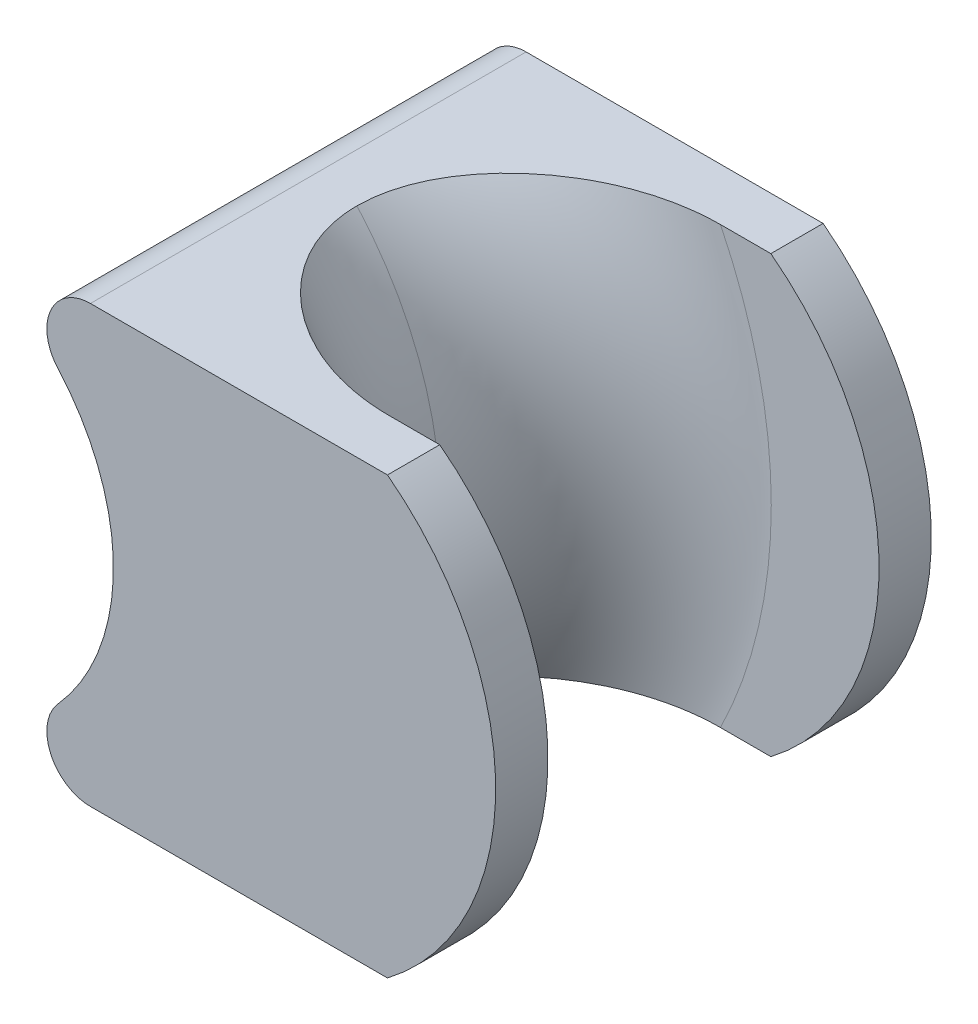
ISO-10303-21;
HEADER;
FILE_DESCRIPTION(('STEP AP214'),'2;1');
FILE_NAME('part.step','',(''),(''),'','','');
FILE_SCHEMA(('AUTOMOTIVE_DESIGN { 1 0 10303 214 1 1 1 1 }'));
ENDSEC;
DATA;
#1=APPLICATION_CONTEXT('core data for automotive mechanical design processes');
#2=APPLICATION_PROTOCOL_DEFINITION('international standard','automotive_design',2000,#1);
#3=PRODUCT_CONTEXT('',#1,'mechanical');
#4=PRODUCT('Part','Part','',(#3));
#5=PRODUCT_RELATED_PRODUCT_CATEGORY('part','',(#4));
#6=PRODUCT_DEFINITION_FORMATION('','',#4);
#7=PRODUCT_DEFINITION_CONTEXT('part definition',#1,'design');
#8=PRODUCT_DEFINITION('design','',#6,#7);
#9=PRODUCT_DEFINITION_SHAPE('','',#8);
#10=(LENGTH_UNIT() NAMED_UNIT(*) SI_UNIT(.MILLI.,.METRE.));
#11=(NAMED_UNIT(*) PLANE_ANGLE_UNIT() SI_UNIT($,.RADIAN.));
#12=(NAMED_UNIT(*) SI_UNIT($,.STERADIAN.) SOLID_ANGLE_UNIT());
#13=UNCERTAINTY_MEASURE_WITH_UNIT(LENGTH_MEASURE(1.E-05),#10,'distance_accuracy_value','');
#14=(GEOMETRIC_REPRESENTATION_CONTEXT(3) GLOBAL_UNCERTAINTY_ASSIGNED_CONTEXT((#13)) GLOBAL_UNIT_ASSIGNED_CONTEXT((#10,
#11,#12)) REPRESENTATION_CONTEXT('',''));
#15=CARTESIAN_POINT('',(0.,0.,0.));
#16=DIRECTION('',(0.,0.,1.));
#17=DIRECTION('',(1.,0.,0.));
#18=AXIS2_PLACEMENT_3D('',#15,#16,#17);
#19=CARTESIAN_POINT('',(0.,0.,12.7));
#20=DIRECTION('',(0.,0.,-1.));
#21=DIRECTION('',(-1.,0.,0.));
#22=AXIS2_PLACEMENT_3D('',#19,#20,#21);
#23=CYLINDRICAL_SURFACE('',#22,6.35);
#24=CARTESIAN_POINT('',(0.,0.,0.));
#25=DIRECTION('',(0.,0.,1.));
#26=DIRECTION('',(1.,0.,0.));
#27=AXIS2_PLACEMENT_3D('',#24,#25,#26);
#28=CIRCLE('',#27,6.35);
#29=CARTESIAN_POINT('',(4.73301055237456,-4.23333333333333,0.));
#30=VERTEX_POINT('',#29);
#31=CARTESIAN_POINT('',(4.73301055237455,4.23333333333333,0.));
#32=VERTEX_POINT('',#31);
#33=EDGE_CURVE('E163',#30,#32,#28,.T.);
#34=ORIENTED_EDGE('',*,*,#33,.F.);
#35=DIRECTION('',(0.,0.,-1.));
#36=VECTOR('',#35,1.);
#37=CARTESIAN_POINT('',(4.73301055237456,-4.23333333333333,12.7));
#38=LINE('',#37,#36);
#39=CARTESIAN_POINT('',(4.73301055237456,-4.23333333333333,12.7));
#40=VERTEX_POINT('',#39);
#41=EDGE_CURVE('E232',#30,#40,#38,.F.);
#42=ORIENTED_EDGE('',*,*,#41,.T.);
#43=CARTESIAN_POINT('',(0.,0.,12.7));
#44=DIRECTION('',(0.,0.,1.));
#45=DIRECTION('',(1.,0.,0.));
#46=AXIS2_PLACEMENT_3D('',#43,#44,#45);
#47=CIRCLE('',#46,6.35);
#48=CARTESIAN_POINT('',(4.73301055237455,4.23333333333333,12.7));
#49=VERTEX_POINT('',#48);
#50=EDGE_CURVE('E166',#40,#49,#47,.T.);
#51=ORIENTED_EDGE('',*,*,#50,.T.);
#52=DIRECTION('',(0.,0.,-1.));
#53=VECTOR('',#52,1.);
#54=CARTESIAN_POINT('',(4.73301055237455,4.23333333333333,12.7));
#55=LINE('',#54,#53);
#56=EDGE_CURVE('E229',#49,#32,#55,.T.);
#57=ORIENTED_EDGE('',*,*,#56,.T.);
#58=EDGE_LOOP('',(#34,#42,#51,#57));
#59=FACE_BOUND('',#58,.T.);
#60=ADVANCED_FACE('F37',(#59),#23,.F.);
#61=CARTESIAN_POINT('',(0.,-6.35,12.7));
#62=DIRECTION('',(0.,1.,0.));
#63=DIRECTION('',(0.,0.,1.));
#64=AXIS2_PLACEMENT_3D('',#61,#62,#63);
#65=PLANE('',#64);
#66=DIRECTION('',(1.,0.,0.));
#67=VECTOR('',#66,1.);
#68=CARTESIAN_POINT('',(0.,-6.35,12.7));
#69=LINE('',#68,#67);
#70=CARTESIAN_POINT('',(5.67961266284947,-6.35,12.7));
#71=VERTEX_POINT('',#70);
#72=CARTESIAN_POINT('',(14.3385158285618,-6.35,12.7));
#73=VERTEX_POINT('',#72);
#74=EDGE_CURVE('E168',#71,#73,#69,.T.);
#75=ORIENTED_EDGE('',*,*,#74,.F.);
#76=DIRECTION('',(0.,0.,1.));
#77=VECTOR('',#76,1.);
#78=CARTESIAN_POINT('',(5.67961266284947,-6.35,0.));
#79=LINE('',#78,#77);
#80=CARTESIAN_POINT('',(5.67961266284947,-6.35,0.));
#81=VERTEX_POINT('',#80);
#82=EDGE_CURVE('E222',#71,#81,#79,.F.);
#83=ORIENTED_EDGE('',*,*,#82,.T.);
#84=DIRECTION('',(1.,0.,0.));
#85=VECTOR('',#84,1.);
#86=CARTESIAN_POINT('',(0.,-6.35,0.));
#87=LINE('',#86,#85);
#88=CARTESIAN_POINT('',(14.3385158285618,-6.35,0.));
#89=VERTEX_POINT('',#88);
#90=EDGE_CURVE('E176',#81,#89,#87,.T.);
#91=ORIENTED_EDGE('',*,*,#90,.T.);
#92=DIRECTION('',(0.,0.,-1.));
#93=VECTOR('',#92,1.);
#94=CARTESIAN_POINT('',(14.3385158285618,-6.35,1.524));
#95=LINE('',#94,#93);
#96=CARTESIAN_POINT('',(14.3385158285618,-6.35,1.524));
#97=VERTEX_POINT('',#96);
#98=EDGE_CURVE('E142',#97,#89,#95,.T.);
#99=ORIENTED_EDGE('',*,*,#98,.F.);
#100=DIRECTION('',(1.,0.,0.));
#101=VECTOR('',#100,1.);
#102=CARTESIAN_POINT('',(7.09951582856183,-6.35,1.524));
#103=LINE('',#102,#101);
#104=CARTESIAN_POINT('',(12.8696814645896,-6.35,1.524));
#105=VERTEX_POINT('',#104);
#106=EDGE_CURVE('E134',#105,#97,#103,.T.);
#107=ORIENTED_EDGE('',*,*,#106,.F.);
#108=CARTESIAN_POINT('',(12.8696814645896,-6.35,1.524));
#109=CARTESIAN_POINT('',(12.6630423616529,-6.35,1.52398428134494));
#110=CARTESIAN_POINT('',(12.4564641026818,-6.35,1.5346716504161));
#111=CARTESIAN_POINT('',(12.0454777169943,-6.35,1.57670436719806));
#112=CARTESIAN_POINT('',(11.8410689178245,-6.35,1.60804311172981));
#113=CARTESIAN_POINT('',(11.4364085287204,-6.35,1.69061637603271));
#114=CARTESIAN_POINT('',(11.2361554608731,-6.35,1.7418436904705));
#115=CARTESIAN_POINT('',(10.8415499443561,-6.35,1.86340282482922));
#116=CARTESIAN_POINT('',(10.6471970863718,-6.35,1.9337333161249));
#117=CARTESIAN_POINT('',(10.2940935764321,-6.35,2.08108120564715));
#118=CARTESIAN_POINT('',(10.134300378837,-6.35,2.15560705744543));
#119=CARTESIAN_POINT('',(9.82145750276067,-6.35,2.31754343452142));
#120=CARTESIAN_POINT('',(9.66840733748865,-6.35,2.40495302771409));
#121=CARTESIAN_POINT('',(9.22119005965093,-6.35,2.68588662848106));
#122=CARTESIAN_POINT('',(8.93845785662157,-6.35,2.89832275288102));
#123=CARTESIAN_POINT('',(8.46826655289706,-6.35,3.32291475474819));
#124=CARTESIAN_POINT('',(8.27307394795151,-6.35,3.52657350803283));
#125=CARTESIAN_POINT('',(7.91774045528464,-6.35,3.96255368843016));
#126=CARTESIAN_POINT('',(7.75755341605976,-6.35,4.19483673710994));
#127=CARTESIAN_POINT('',(7.51059008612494,-6.35,4.63514212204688));
#128=CARTESIAN_POINT('',(7.41550445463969,-6.35,4.8384478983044));
#129=CARTESIAN_POINT('',(7.29904041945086,-6.35,5.15275782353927));
#130=CARTESIAN_POINT('',(7.26459480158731,-6.35,5.25900864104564));
#131=CARTESIAN_POINT('',(7.20503464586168,-6.35,5.47407733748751));
#132=CARTESIAN_POINT('',(7.17991616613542,-6.35,5.58289411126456));
#133=CARTESIAN_POINT('',(7.13984854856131,-6.35,5.8009407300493));
#134=CARTESIAN_POINT('',(7.12477261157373,-6.35,5.91014720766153));
#135=CARTESIAN_POINT('',(7.10458148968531,-6.35,6.12956070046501));
#136=CARTESIAN_POINT('',(7.09947418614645,-6.35,6.23976843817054));
#137=CARTESIAN_POINT('',(7.09951582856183,-6.35,6.35));
#138=B_SPLINE_CURVE_WITH_KNOTS('',3,(#108,#109,#110,#111,#112,#113,#114,#115,#116,#117,#118,
#119,#120,#121,#122,#123,#124,#125,#126,#127,#128,#129,#130,#131,#132,#133,#134,#135,#136,#137),
.UNSPECIFIED.,.F.,.F.,(4,2,2,2,2,2,2,2,2,2,2,2,2,2,4),(0.,0.619554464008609,1.23891092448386,
1.85804321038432,2.47713244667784,3.00546923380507,3.53376781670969,4.58876483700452,
5.43206940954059,6.2742553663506,6.94464668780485,7.27937368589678,7.61395905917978,
7.9442354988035,8.27477295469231),.UNSPECIFIED.);
#139=CARTESIAN_POINT('',(7.09951582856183,-6.35,6.35));
#140=VERTEX_POINT('',#139);
#141=EDGE_CURVE('E217',#105,#140,#138,.T.);
#142=ORIENTED_EDGE('',*,*,#141,.T.);
#143=CARTESIAN_POINT('',(7.09951582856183,-6.35,6.35));
#144=CARTESIAN_POINT('',(7.09946628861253,-6.35,6.46524627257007));
#145=CARTESIAN_POINT('',(7.10505270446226,-6.35,6.58046410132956));
#146=CARTESIAN_POINT('',(7.12711322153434,-6.35,6.80974171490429));
#147=CARTESIAN_POINT('',(7.14357652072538,-6.35,6.92380253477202));
#148=CARTESIAN_POINT('',(7.18680699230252,-6.35,7.14885120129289));
#149=CARTESIAN_POINT('',(7.21347739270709,-6.35,7.25985771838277));
#150=CARTESIAN_POINT('',(7.27647529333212,-6.35,7.47908171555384));
#151=CARTESIAN_POINT('',(7.31280474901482,-6.35,7.58729862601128));
#152=CARTESIAN_POINT('',(7.4348662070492,-6.35,7.90590440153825));
#153=CARTESIAN_POINT('',(7.533887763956,-6.35,8.11131809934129));
#154=CARTESIAN_POINT('',(7.76130576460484,-6.35,8.5055238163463));
#155=CARTESIAN_POINT('',(7.88978678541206,-6.35,8.69426576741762));
#156=CARTESIAN_POINT('',(8.22651304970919,-6.35,9.12476575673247));
#157=CARTESIAN_POINT('',(8.44613610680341,-6.35,9.35765589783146));
#158=CARTESIAN_POINT('',(8.92020334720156,-6.35,9.78462354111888));
#159=CARTESIAN_POINT('',(9.17468495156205,-6.35,9.9786587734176));
#160=CARTESIAN_POINT('',(9.7135205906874,-6.35,10.3281364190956));
#161=CARTESIAN_POINT('',(9.99821829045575,-6.35,10.4830474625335));
#162=CARTESIAN_POINT('',(10.5873097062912,-6.35,10.7483008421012));
#163=CARTESIAN_POINT('',(10.8916823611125,-6.35,10.8586899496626));
#164=CARTESIAN_POINT('',(11.4735621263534,-6.35,11.0210308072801));
#165=CARTESIAN_POINT('',(11.7494885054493,-6.35,11.0786731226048));
#166=CARTESIAN_POINT('',(12.3067539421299,-6.35,11.1561855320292));
#167=CARTESIAN_POINT('',(12.5880964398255,-6.35,11.1760307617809));
#168=CARTESIAN_POINT('',(12.8696814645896,-6.35,11.176));
#169=B_SPLINE_CURVE_WITH_KNOTS('',3,(#143,#144,#145,#146,#147,#148,#149,#150,#151,#152,#153,
#154,#155,#156,#157,#158,#159,#160,#161,#162,#163,#164,#165,#166,#167,#168),.UNSPECIFIED.,.F.,
.F.,(4,2,2,2,2,2,2,2,2,2,2,2,4),(0.,0.345557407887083,0.69077215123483,1.03279194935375,
1.37488104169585,2.05582746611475,2.73875389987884,3.69398181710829,4.65024333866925,
5.6188676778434,6.58647178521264,7.42960555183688,8.27329377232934),.UNSPECIFIED.);
#170=CARTESIAN_POINT('',(12.8696814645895,-6.35000000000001,11.176));
#171=VERTEX_POINT('',#170);
#172=EDGE_CURVE('E183',#140,#171,#169,.T.);
#173=ORIENTED_EDGE('',*,*,#172,.T.);
#174=DIRECTION('',(1.,0.,0.));
#175=VECTOR('',#174,1.);
#176=CARTESIAN_POINT('',(0.,-6.35,11.176));
#177=LINE('',#176,#175);
#178=CARTESIAN_POINT('',(14.3385158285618,-6.35,11.176));
#179=VERTEX_POINT('',#178);
#180=EDGE_CURVE('E152',#171,#179,#177,.T.);
#181=ORIENTED_EDGE('',*,*,#180,.T.);
#182=DIRECTION('',(0.,0.,1.));
#183=VECTOR('',#182,1.);
#184=CARTESIAN_POINT('',(14.3385158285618,-6.35,11.176));
#185=LINE('',#184,#183);
#186=EDGE_CURVE('E157',#179,#73,#185,.T.);
#187=ORIENTED_EDGE('',*,*,#186,.T.);
#188=EDGE_LOOP('',(#75,#83,#91,#99,#107,#142,#173,#181,#187));
#189=FACE_BOUND('',#188,.T.);
#190=ADVANCED_FACE('F196',(#189),#65,.F.);
#191=CARTESIAN_POINT('',(0.,6.35,12.7));
#192=DIRECTION('',(0.,1.,0.));
#193=DIRECTION('',(-1.,0.,0.));
#194=AXIS2_PLACEMENT_3D('',#191,#192,#193);
#195=PLANE('',#194);
#196=DIRECTION('',(1.,0.,0.));
#197=VECTOR('',#196,1.);
#198=CARTESIAN_POINT('',(0.,6.35,0.));
#199=LINE('',#198,#197);
#200=CARTESIAN_POINT('',(5.67961266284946,6.35,0.));
#201=VERTEX_POINT('',#200);
#202=CARTESIAN_POINT('',(14.3385158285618,6.35,0.));
#203=VERTEX_POINT('',#202);
#204=EDGE_CURVE('E169',#201,#203,#199,.T.);
#205=ORIENTED_EDGE('',*,*,#204,.F.);
#206=DIRECTION('',(0.,0.,-1.));
#207=VECTOR('',#206,1.);
#208=CARTESIAN_POINT('',(5.67961266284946,6.35,12.7));
#209=LINE('',#208,#207);
#210=CARTESIAN_POINT('',(5.67961266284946,6.35,12.7));
#211=VERTEX_POINT('',#210);
#212=EDGE_CURVE('E11',#201,#211,#209,.F.);
#213=ORIENTED_EDGE('',*,*,#212,.T.);
#214=DIRECTION('',(1.,0.,0.));
#215=VECTOR('',#214,1.);
#216=CARTESIAN_POINT('',(0.,6.35,12.7));
#217=LINE('',#216,#215);
#218=CARTESIAN_POINT('',(14.3385158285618,6.35,12.7));
#219=VERTEX_POINT('',#218);
#220=EDGE_CURVE('E171',#211,#219,#217,.T.);
#221=ORIENTED_EDGE('',*,*,#220,.T.);
#222=DIRECTION('',(0.,0.,1.));
#223=VECTOR('',#222,1.);
#224=CARTESIAN_POINT('',(14.3385158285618,6.35,11.176));
#225=LINE('',#224,#223);
#226=CARTESIAN_POINT('',(14.3385158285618,6.35,11.176));
#227=VERTEX_POINT('',#226);
#228=EDGE_CURVE('E160',#227,#219,#225,.T.);
#229=ORIENTED_EDGE('',*,*,#228,.F.);
#230=DIRECTION('',(-1.,0.,0.));
#231=VECTOR('',#230,1.);
#232=CARTESIAN_POINT('',(7.09951582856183,6.35,11.176));
#233=LINE('',#232,#231);
#234=CARTESIAN_POINT('',(12.8696814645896,6.35,11.176));
#235=VERTEX_POINT('',#234);
#236=EDGE_CURVE('E149',#227,#235,#233,.T.);
#237=ORIENTED_EDGE('',*,*,#236,.T.);
#238=CARTESIAN_POINT('',(12.8696814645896,6.35,11.176));
#239=CARTESIAN_POINT('',(12.6630423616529,6.35,11.1760157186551));
#240=CARTESIAN_POINT('',(12.4564641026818,6.35,11.1653283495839));
#241=CARTESIAN_POINT('',(12.0454777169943,6.35,11.1232956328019));
#242=CARTESIAN_POINT('',(11.8410689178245,6.35,11.0919568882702));
#243=CARTESIAN_POINT('',(11.4364085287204,6.35,11.0093836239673));
#244=CARTESIAN_POINT('',(11.2361554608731,6.35,10.9581563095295));
#245=CARTESIAN_POINT('',(10.8415499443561,6.35,10.8365971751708));
#246=CARTESIAN_POINT('',(10.6471970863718,6.35,10.7662666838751));
#247=CARTESIAN_POINT('',(10.2940935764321,6.35,10.6189187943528));
#248=CARTESIAN_POINT('',(10.134300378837,6.35,10.5443929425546));
#249=CARTESIAN_POINT('',(9.82145750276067,6.35,10.3824565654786));
#250=CARTESIAN_POINT('',(9.66840733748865,6.35,10.2950469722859));
#251=CARTESIAN_POINT('',(9.22119005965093,6.35,10.0141133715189));
#252=CARTESIAN_POINT('',(8.93845785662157,6.35,9.80167724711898));
#253=CARTESIAN_POINT('',(8.46826655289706,6.35,9.37708524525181));
#254=CARTESIAN_POINT('',(8.27307394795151,6.35,9.17342649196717));
#255=CARTESIAN_POINT('',(7.91774045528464,6.35,8.73744631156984));
#256=CARTESIAN_POINT('',(7.75755341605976,6.35,8.50516326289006));
#257=CARTESIAN_POINT('',(7.51059008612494,6.35,8.06485787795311));
#258=CARTESIAN_POINT('',(7.41550445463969,6.35,7.8615521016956));
#259=CARTESIAN_POINT('',(7.29904041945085,6.35,7.54724217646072));
#260=CARTESIAN_POINT('',(7.2645948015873,6.35,7.44099135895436));
#261=CARTESIAN_POINT('',(7.20503464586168,6.35,7.22592266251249));
#262=CARTESIAN_POINT('',(7.17991616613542,6.35,7.11710588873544));
#263=CARTESIAN_POINT('',(7.13984854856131,6.35,6.8990592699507));
#264=CARTESIAN_POINT('',(7.12477261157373,6.35,6.78985279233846));
#265=CARTESIAN_POINT('',(7.10458148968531,6.35,6.57043929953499));
#266=CARTESIAN_POINT('',(7.09947418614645,6.35,6.46023156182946));
#267=CARTESIAN_POINT('',(7.09951582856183,6.35,6.35));
#268=B_SPLINE_CURVE_WITH_KNOTS('',3,(#238,#239,#240,#241,#242,#243,#244,#245,#246,#247,#248,
#249,#250,#251,#252,#253,#254,#255,#256,#257,#258,#259,#260,#261,#262,#263,#264,#265,#266,#267),
.UNSPECIFIED.,.F.,.F.,(4,2,2,2,2,2,2,2,2,2,2,2,2,2,4),(0.,0.619554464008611,1.23891092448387,
1.85804321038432,2.47713244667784,3.00546923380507,3.5337678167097,4.58876483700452,
5.43206940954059,6.27425536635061,6.94464668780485,7.27937368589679,7.61395905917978,
7.94423549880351,8.27477295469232),.UNSPECIFIED.);
#269=CARTESIAN_POINT('',(7.09951582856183,6.35,6.35));
#270=VERTEX_POINT('',#269);
#271=EDGE_CURVE('E190',#235,#270,#268,.T.);
#272=ORIENTED_EDGE('',*,*,#271,.T.);
#273=CARTESIAN_POINT('',(7.09951582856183,6.35,6.35));
#274=CARTESIAN_POINT('',(7.09946628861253,6.35,6.23475372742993));
#275=CARTESIAN_POINT('',(7.10505270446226,6.35,6.11953589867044));
#276=CARTESIAN_POINT('',(7.12711322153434,6.35,5.89025828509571));
#277=CARTESIAN_POINT('',(7.14357652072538,6.35,5.77619746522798));
#278=CARTESIAN_POINT('',(7.18680699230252,6.35,5.55114879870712));
#279=CARTESIAN_POINT('',(7.21347739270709,6.35,5.44014228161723));
#280=CARTESIAN_POINT('',(7.27647529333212,6.35,5.22091828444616));
#281=CARTESIAN_POINT('',(7.31280474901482,6.35,5.11270137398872));
#282=CARTESIAN_POINT('',(7.4348662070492,6.35,4.79409559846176));
#283=CARTESIAN_POINT('',(7.53388776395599,6.35,4.58868190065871));
#284=CARTESIAN_POINT('',(7.76130576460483,6.35,4.1944761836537));
#285=CARTESIAN_POINT('',(7.88978678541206,6.35,4.00573423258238));
#286=CARTESIAN_POINT('',(8.22651304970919,6.35,3.57523424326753));
#287=CARTESIAN_POINT('',(8.44613610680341,6.35,3.34234410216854));
#288=CARTESIAN_POINT('',(8.92020334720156,6.35,2.91537645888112));
#289=CARTESIAN_POINT('',(9.17468495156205,6.35,2.7213412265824));
#290=CARTESIAN_POINT('',(9.71352059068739,6.35,2.37186358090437));
#291=CARTESIAN_POINT('',(9.99821829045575,6.35,2.21695253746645));
#292=CARTESIAN_POINT('',(10.5873097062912,6.35,1.95169915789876));
#293=CARTESIAN_POINT('',(10.8916823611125,6.35,1.84131005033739));
#294=CARTESIAN_POINT('',(11.4735621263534,6.35,1.67896919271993));
#295=CARTESIAN_POINT('',(11.7494885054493,6.35,1.62132687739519));
#296=CARTESIAN_POINT('',(12.3067539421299,6.35,1.54381446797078));
#297=CARTESIAN_POINT('',(12.5880964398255,6.35,1.52396923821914));
#298=CARTESIAN_POINT('',(12.8696814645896,6.35,1.524));
#299=B_SPLINE_CURVE_WITH_KNOTS('',3,(#273,#274,#275,#276,#277,#278,#279,#280,#281,#282,#283,
#284,#285,#286,#287,#288,#289,#290,#291,#292,#293,#294,#295,#296,#297,#298),.UNSPECIFIED.,.F.,
.F.,(4,2,2,2,2,2,2,2,2,2,2,2,4),(0.,0.345557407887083,0.69077215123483,1.03279194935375,
1.37488104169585,2.05582746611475,2.73875389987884,3.69398181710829,4.65024333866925,
5.6188676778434,6.58647178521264,7.42960555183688,8.27329377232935),.UNSPECIFIED.);
#300=CARTESIAN_POINT('',(12.8696814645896,6.35,1.524));
#301=VERTEX_POINT('',#300);
#302=EDGE_CURVE('E125',#270,#301,#299,.T.);
#303=ORIENTED_EDGE('',*,*,#302,.T.);
#304=DIRECTION('',(-1.,0.,0.));
#305=VECTOR('',#304,1.);
#306=CARTESIAN_POINT('',(7.09951582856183,6.35,1.524));
#307=LINE('',#306,#305);
#308=CARTESIAN_POINT('',(14.3385158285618,6.35,1.524));
#309=VERTEX_POINT('',#308);
#310=EDGE_CURVE('E119',#309,#301,#307,.T.);
#311=ORIENTED_EDGE('',*,*,#310,.F.);
#312=DIRECTION('',(0.,0.,-1.));
#313=VECTOR('',#312,1.);
#314=CARTESIAN_POINT('',(14.3385158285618,6.35,1.524));
#315=LINE('',#314,#313);
#316=EDGE_CURVE('E123',#309,#203,#315,.T.);
#317=ORIENTED_EDGE('',*,*,#316,.T.);
#318=EDGE_LOOP('',(#205,#213,#221,#229,#237,#272,#303,#311,#317));
#319=FACE_BOUND('',#318,.T.);
#320=ADVANCED_FACE('F121',(#319),#195,.T.);
#321=CARTESIAN_POINT('',(0.,0.,12.7));
#322=DIRECTION('',(0.,0.,1.));
#323=DIRECTION('',(1.,0.,0.));
#324=AXIS2_PLACEMENT_3D('',#321,#322,#323);
#325=PLANE('',#324);
#326=ORIENTED_EDGE('',*,*,#50,.F.);
#327=CARTESIAN_POINT('',(5.67961266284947,-5.08,12.7));
#328=DIRECTION('',(0.,0.,1.));
#329=DIRECTION('',(1.,0.,0.));
#330=AXIS2_PLACEMENT_3D('',#327,#328,#329);
#331=CIRCLE('',#330,1.27);
#332=EDGE_CURVE('E45',#40,#71,#331,.T.);
#333=ORIENTED_EDGE('',*,*,#332,.T.);
#334=ORIENTED_EDGE('',*,*,#74,.T.);
#335=CARTESIAN_POINT('',(9.525,0.,12.7));
#336=DIRECTION('',(0.,0.,1.));
#337=DIRECTION('',(-1.,0.,0.));
#338=AXIS2_PLACEMENT_3D('',#335,#336,#337);
#339=CIRCLE('',#338,7.96821401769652);
#340=EDGE_CURVE('E144',#73,#219,#339,.T.);
#341=ORIENTED_EDGE('',*,*,#340,.T.);
#342=ORIENTED_EDGE('',*,*,#220,.F.);
#343=CARTESIAN_POINT('',(5.67961266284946,5.08,12.7));
#344=DIRECTION('',(0.,0.,1.));
#345=DIRECTION('',(1.,0.,0.));
#346=AXIS2_PLACEMENT_3D('',#343,#344,#345);
#347=CIRCLE('',#346,1.27);
#348=EDGE_CURVE('E57',#211,#49,#347,.T.);
#349=ORIENTED_EDGE('',*,*,#348,.T.);
#350=EDGE_LOOP('',(#326,#333,#334,#341,#342,#349));
#351=FACE_BOUND('',#350,.T.);
#352=ADVANCED_FACE('F236',(#351),#325,.T.);
#353=CARTESIAN_POINT('',(0.,0.,0.));
#354=DIRECTION('',(0.,0.,1.));
#355=DIRECTION('',(1.,0.,0.));
#356=AXIS2_PLACEMENT_3D('',#353,#354,#355);
#357=PLANE('',#356);
#358=ORIENTED_EDGE('',*,*,#90,.F.);
#359=CARTESIAN_POINT('',(5.67961266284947,-5.08,0.));
#360=DIRECTION('',(0.,0.,1.));
#361=DIRECTION('',(1.,0.,0.));
#362=AXIS2_PLACEMENT_3D('',#359,#360,#361);
#363=CIRCLE('',#362,1.27);
#364=EDGE_CURVE('E227',#81,#30,#363,.F.);
#365=ORIENTED_EDGE('',*,*,#364,.T.);
#366=ORIENTED_EDGE('',*,*,#33,.T.);
#367=CARTESIAN_POINT('',(5.67961266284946,5.08,0.));
#368=DIRECTION('',(0.,0.,1.));
#369=DIRECTION('',(1.,0.,0.));
#370=AXIS2_PLACEMENT_3D('',#367,#368,#369);
#371=CIRCLE('',#370,1.27);
#372=EDGE_CURVE('E225',#32,#201,#371,.F.);
#373=ORIENTED_EDGE('',*,*,#372,.T.);
#374=ORIENTED_EDGE('',*,*,#204,.T.);
#375=CARTESIAN_POINT('',(9.525,0.,0.));
#376=DIRECTION('',(0.,0.,1.));
#377=DIRECTION('',(-1.,0.,0.));
#378=AXIS2_PLACEMENT_3D('',#375,#376,#377);
#379=CIRCLE('',#378,7.96821401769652);
#380=EDGE_CURVE('E129',#89,#203,#379,.T.);
#381=ORIENTED_EDGE('',*,*,#380,.F.);
#382=EDGE_LOOP('',(#358,#365,#366,#373,#374,#381));
#383=FACE_BOUND('',#382,.T.);
#384=ADVANCED_FACE('F246',(#383),#357,.F.);
#385=CARTESIAN_POINT('',(9.525,0.,11.176));
#386=DIRECTION('',(0.,0.,1.));
#387=DIRECTION('',(1.,0.,0.));
#388=AXIS2_PLACEMENT_3D('',#385,#386,#387);
#389=CYLINDRICAL_SURFACE('',#388,7.96821401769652);
#390=ORIENTED_EDGE('',*,*,#340,.F.);
#391=ORIENTED_EDGE('',*,*,#186,.F.);
#392=CARTESIAN_POINT('',(9.525,0.,11.176));
#393=DIRECTION('',(0.,0.,1.));
#394=DIRECTION('',(-1.,0.,0.));
#395=AXIS2_PLACEMENT_3D('',#392,#393,#394);
#396=CIRCLE('',#395,7.96821401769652);
#397=EDGE_CURVE('E154',#179,#227,#396,.T.);
#398=ORIENTED_EDGE('',*,*,#397,.T.);
#399=ORIENTED_EDGE('',*,*,#228,.T.);
#400=EDGE_LOOP('',(#390,#391,#398,#399));
#401=FACE_BOUND('',#400,.T.);
#402=ADVANCED_FACE('F270',(#401),#389,.T.);
#403=CARTESIAN_POINT('',(0.,0.,11.176));
#404=DIRECTION('',(0.,0.,1.));
#405=DIRECTION('',(1.,0.,0.));
#406=AXIS2_PLACEMENT_3D('',#403,#404,#405);
#407=PLANE('',#406);
#408=ORIENTED_EDGE('',*,*,#180,.F.);
#409=CARTESIAN_POINT('',(0.,0.,11.176));
#410=DIRECTION('',(0.,0.,1.));
#411=DIRECTION('',(1.,0.,0.));
#412=AXIS2_PLACEMENT_3D('',#409,#410,#411);
#413=CIRCLE('',#412,14.351);
#414=EDGE_CURVE('E181',#171,#235,#413,.T.);
#415=ORIENTED_EDGE('',*,*,#414,.T.);
#416=ORIENTED_EDGE('',*,*,#236,.F.);
#417=ORIENTED_EDGE('',*,*,#397,.F.);
#418=EDGE_LOOP('',(#408,#415,#416,#417));
#419=FACE_BOUND('',#418,.T.);
#420=ADVANCED_FACE('F203',(#419),#407,.F.);
#421=CARTESIAN_POINT('',(0.,0.,6.35));
#422=DIRECTION('',(0.,0.,1.));
#423=DIRECTION('',(1.,0.,0.));
#424=AXIS2_PLACEMENT_3D('',#421,#422,#423);
#425=TOROIDAL_SURFACE('',#424,14.351,4.826);
#426=ORIENTED_EDGE('',*,*,#271,.F.);
#427=ORIENTED_EDGE('',*,*,#414,.F.);
#428=ORIENTED_EDGE('',*,*,#172,.F.);
#429=CARTESIAN_POINT('',(0.,0.,6.35));
#430=DIRECTION('',(0.,0.,1.));
#431=DIRECTION('',(1.,0.,0.));
#432=AXIS2_PLACEMENT_3D('',#429,#430,#431);
#433=CIRCLE('',#432,9.525);
#434=EDGE_CURVE('E173',#270,#140,#433,.F.);
#435=ORIENTED_EDGE('',*,*,#434,.F.);
#436=EDGE_LOOP('',(#426,#427,#428,#435));
#437=FACE_BOUND('',#436,.T.);
#438=ADVANCED_FACE('F199',(#437),#425,.F.);
#439=CARTESIAN_POINT('',(9.525,0.,1.524));
#440=DIRECTION('',(0.,0.,-1.));
#441=DIRECTION('',(-1.,0.,0.));
#442=AXIS2_PLACEMENT_3D('',#439,#440,#441);
#443=CYLINDRICAL_SURFACE('',#442,7.96821401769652);
#444=ORIENTED_EDGE('',*,*,#380,.T.);
#445=ORIENTED_EDGE('',*,*,#316,.F.);
#446=CARTESIAN_POINT('',(9.525,0.,1.524));
#447=DIRECTION('',(0.,0.,1.));
#448=DIRECTION('',(-1.,0.,0.));
#449=AXIS2_PLACEMENT_3D('',#446,#447,#448);
#450=CIRCLE('',#449,7.96821401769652);
#451=EDGE_CURVE('E128',#97,#309,#450,.T.);
#452=ORIENTED_EDGE('',*,*,#451,.F.);
#453=ORIENTED_EDGE('',*,*,#98,.T.);
#454=EDGE_LOOP('',(#444,#445,#452,#453));
#455=FACE_BOUND('',#454,.T.);
#456=ADVANCED_FACE('F140',(#455),#443,.T.);
#457=CARTESIAN_POINT('',(0.,0.,1.524));
#458=DIRECTION('',(0.,0.,-1.));
#459=DIRECTION('',(1.,0.,0.));
#460=AXIS2_PLACEMENT_3D('',#457,#458,#459);
#461=PLANE('',#460);
#462=ORIENTED_EDGE('',*,*,#310,.T.);
#463=CARTESIAN_POINT('',(0.,0.,1.524));
#464=DIRECTION('',(0.,0.,-1.));
#465=DIRECTION('',(-1.,0.,0.));
#466=AXIS2_PLACEMENT_3D('',#463,#464,#465);
#467=CIRCLE('',#466,14.351);
#468=EDGE_CURVE('E386',#301,#105,#467,.T.);
#469=ORIENTED_EDGE('',*,*,#468,.T.);
#470=ORIENTED_EDGE('',*,*,#106,.T.);
#471=ORIENTED_EDGE('',*,*,#451,.T.);
#472=EDGE_LOOP('',(#462,#469,#470,#471));
#473=FACE_BOUND('',#472,.T.);
#474=ADVANCED_FACE('F132',(#473),#461,.F.);
#475=CARTESIAN_POINT('',(0.,0.,6.35));
#476=DIRECTION('',(0.,0.,-1.));
#477=DIRECTION('',(-1.,0.,0.));
#478=AXIS2_PLACEMENT_3D('',#475,#476,#477);
#479=TOROIDAL_SURFACE('',#478,14.351,4.826);
#480=ORIENTED_EDGE('',*,*,#141,.F.);
#481=ORIENTED_EDGE('',*,*,#468,.F.);
#482=ORIENTED_EDGE('',*,*,#302,.F.);
#483=ORIENTED_EDGE('',*,*,#434,.T.);
#484=EDGE_LOOP('',(#480,#481,#482,#483));
#485=FACE_BOUND('',#484,.T.);
#486=ADVANCED_FACE('F205',(#485),#479,.F.);
#487=CARTESIAN_POINT('',(5.67961266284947,-5.08,12.7));
#488=DIRECTION('',(0.,0.,-1.));
#489=DIRECTION('',(-1.,0.,0.));
#490=AXIS2_PLACEMENT_3D('',#487,#488,#489);
#491=CYLINDRICAL_SURFACE('',#490,1.27);
#492=ORIENTED_EDGE('',*,*,#332,.F.);
#493=ORIENTED_EDGE('',*,*,#41,.F.);
#494=ORIENTED_EDGE('',*,*,#364,.F.);
#495=ORIENTED_EDGE('',*,*,#82,.F.);
#496=EDGE_LOOP('',(#492,#493,#494,#495));
#497=FACE_BOUND('',#496,.T.);
#498=ADVANCED_FACE('F209',(#497),#491,.T.);
#499=CARTESIAN_POINT('',(5.67961266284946,5.08,12.7));
#500=DIRECTION('',(0.,0.,-1.));
#501=DIRECTION('',(-1.,0.,0.));
#502=AXIS2_PLACEMENT_3D('',#499,#500,#501);
#503=CYLINDRICAL_SURFACE('',#502,1.27);
#504=ORIENTED_EDGE('',*,*,#348,.F.);
#505=ORIENTED_EDGE('',*,*,#212,.F.);
#506=ORIENTED_EDGE('',*,*,#372,.F.);
#507=ORIENTED_EDGE('',*,*,#56,.F.);
#508=EDGE_LOOP('',(#504,#505,#506,#507));
#509=FACE_BOUND('',#508,.T.);
#510=ADVANCED_FACE('F39',(#509),#503,.T.);
#511=CLOSED_SHELL('',(#60,#190,#320,#352,#384,#402,#420,#438,#456,#474,#486,#498,#510));
#512=MANIFOLD_SOLID_BREP('B2',#511);
#513=ADVANCED_BREP_SHAPE_REPRESENTATION('',(#18,#512),#14);
#514=SHAPE_DEFINITION_REPRESENTATION(#9,#513);
ENDSEC;
END-ISO-10303-21;
